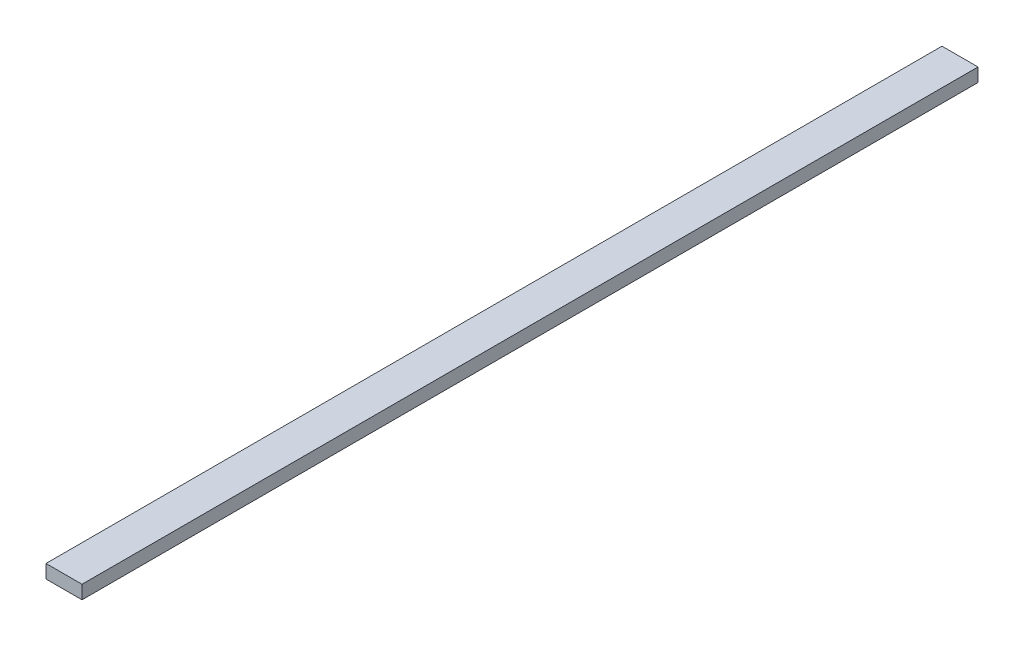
from build123d import *

# Parameters (mm, degrees)
ESQUISSE1_W      = 40
ESQUISSE1_H      = 15
EXTRUSION1_DEPTH = 995


with BuildPart() as part:
    # Esquisse1 → Extrusion1 (new body)
    with BuildSketch(Plane.XY):
        Rectangle(ESQUISSE1_W, ESQUISSE1_H)
    extrude(amount=EXTRUSION1_DEPTH)


solid = part.part
